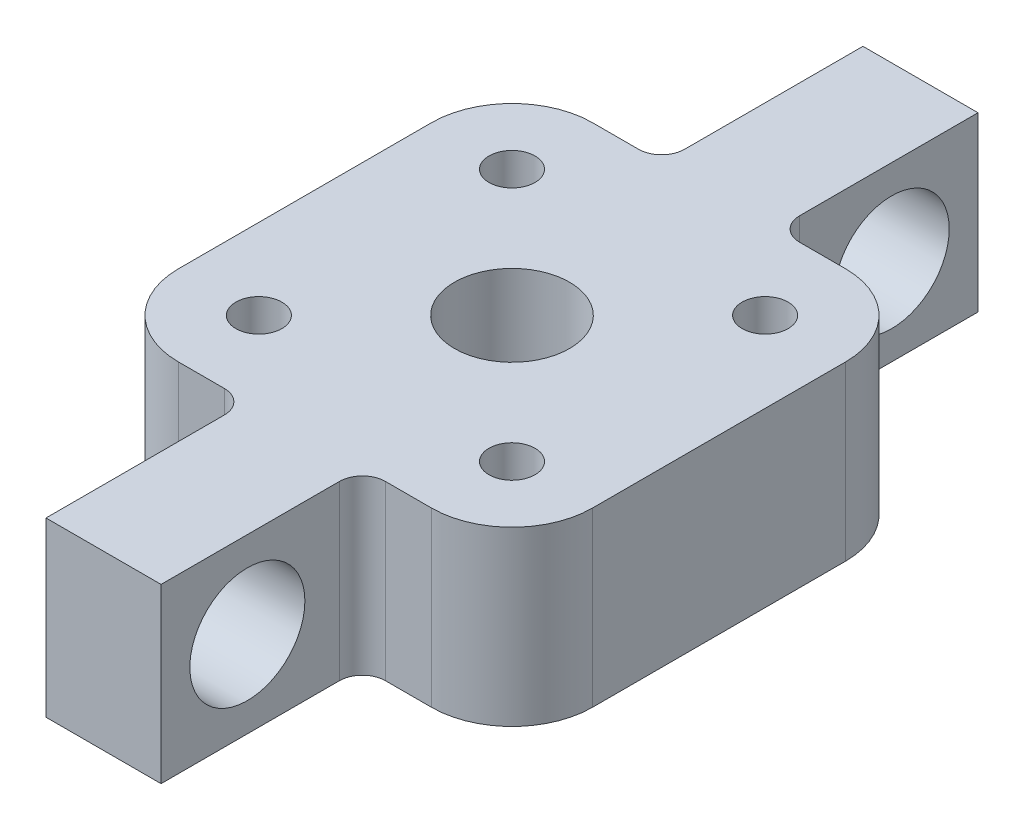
ISO-10303-21;
HEADER;
FILE_DESCRIPTION(('STEP AP214'),'2;1');
FILE_NAME('part.step','',(''),(''),'','','');
FILE_SCHEMA(('AUTOMOTIVE_DESIGN { 1 0 10303 214 1 1 1 1 }'));
ENDSEC;
DATA;
#1=APPLICATION_CONTEXT('core data for automotive mechanical design processes');
#2=APPLICATION_PROTOCOL_DEFINITION('international standard','automotive_design',2000,#1);
#3=PRODUCT_CONTEXT('',#1,'mechanical');
#4=PRODUCT('Part','Part','',(#3));
#5=PRODUCT_RELATED_PRODUCT_CATEGORY('part','',(#4));
#6=PRODUCT_DEFINITION_FORMATION('','',#4);
#7=PRODUCT_DEFINITION_CONTEXT('part definition',#1,'design');
#8=PRODUCT_DEFINITION('design','',#6,#7);
#9=PRODUCT_DEFINITION_SHAPE('','',#8);
#10=(LENGTH_UNIT() NAMED_UNIT(*) SI_UNIT(.MILLI.,.METRE.));
#11=(NAMED_UNIT(*) PLANE_ANGLE_UNIT() SI_UNIT($,.RADIAN.));
#12=(NAMED_UNIT(*) SI_UNIT($,.STERADIAN.) SOLID_ANGLE_UNIT());
#13=UNCERTAINTY_MEASURE_WITH_UNIT(LENGTH_MEASURE(1.E-05),#10,'distance_accuracy_value','');
#14=(GEOMETRIC_REPRESENTATION_CONTEXT(3) GLOBAL_UNCERTAINTY_ASSIGNED_CONTEXT((#13)) GLOBAL_UNIT_ASSIGNED_CONTEXT((#10,
#11,#12)) REPRESENTATION_CONTEXT('',''));
#15=CARTESIAN_POINT('',(0.,0.,0.));
#16=DIRECTION('',(0.,0.,1.));
#17=DIRECTION('',(1.,0.,0.));
#18=AXIS2_PLACEMENT_3D('',#15,#16,#17);
#19=CARTESIAN_POINT('',(0.,7.5,0.));
#20=DIRECTION('',(0.,1.,0.));
#21=DIRECTION('',(0.,0.,1.));
#22=AXIS2_PLACEMENT_3D('',#19,#20,#21);
#23=PLANE('',#22);
#24=CARTESIAN_POINT('',(11.,7.5,-11.));
#25=DIRECTION('',(0.,1.,0.));
#26=DIRECTION('',(0.,0.,1.));
#27=AXIS2_PLACEMENT_3D('',#24,#25,#26);
#28=CIRCLE('',#27,2.);
#29=CARTESIAN_POINT('',(11.,7.5,-9.));
#30=VERTEX_POINT('',#29);
#31=EDGE_CURVE('E476',#30,#30,#28,.T.);
#32=ORIENTED_EDGE('',*,*,#31,.F.);
#33=EDGE_LOOP('',(#32));
#34=FACE_BOUND('',#33,.T.);
#35=CARTESIAN_POINT('',(-11.,7.5,11.));
#36=DIRECTION('',(0.,1.,0.));
#37=DIRECTION('',(0.,0.,1.));
#38=AXIS2_PLACEMENT_3D('',#35,#36,#37);
#39=CIRCLE('',#38,2.);
#40=CARTESIAN_POINT('',(-11.,7.5,13.));
#41=VERTEX_POINT('',#40);
#42=EDGE_CURVE('E464',#41,#41,#39,.T.);
#43=ORIENTED_EDGE('',*,*,#42,.F.);
#44=EDGE_LOOP('',(#43));
#45=FACE_BOUND('',#44,.T.);
#46=DIRECTION('',(0.,0.,-1.));
#47=VECTOR('',#46,1.);
#48=CARTESIAN_POINT('',(5.,7.5,35.5));
#49=LINE('',#48,#47);
#50=CARTESIAN_POINT('',(5.,7.5,35.5));
#51=VERTEX_POINT('',#50);
#52=CARTESIAN_POINT('',(5.00000000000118,7.5,19.9999999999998));
#53=VERTEX_POINT('',#52);
#54=EDGE_CURVE('E206',#51,#53,#49,.T.);
#55=ORIENTED_EDGE('',*,*,#54,.T.);
#56=CARTESIAN_POINT('',(7.00000000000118,7.5,20.));
#57=DIRECTION('',(0.,1.,0.));
#58=DIRECTION('',(0.,0.,1.));
#59=AXIS2_PLACEMENT_3D('',#56,#57,#58);
#60=CIRCLE('',#59,2.);
#61=CARTESIAN_POINT('',(7.00000000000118,7.5,18.));
#62=VERTEX_POINT('',#61);
#63=EDGE_CURVE('E11',#53,#62,#60,.F.);
#64=ORIENTED_EDGE('',*,*,#63,.T.);
#65=DIRECTION('',(1.,0.,0.));
#66=VECTOR('',#65,1.);
#67=CARTESIAN_POINT('',(18.,7.5,18.));
#68=LINE('',#67,#66);
#69=CARTESIAN_POINT('',(11.,7.5,18.));
#70=VERTEX_POINT('',#69);
#71=EDGE_CURVE('E208',#62,#70,#68,.T.);
#72=ORIENTED_EDGE('',*,*,#71,.T.);
#73=CARTESIAN_POINT('',(11.,7.5,11.));
#74=DIRECTION('',(0.,1.,0.));
#75=DIRECTION('',(0.,0.,1.));
#76=AXIS2_PLACEMENT_3D('',#73,#74,#75);
#77=CIRCLE('',#76,7.);
#78=CARTESIAN_POINT('',(18.,7.5,11.));
#79=VERTEX_POINT('',#78);
#80=EDGE_CURVE('E290',#70,#79,#77,.T.);
#81=ORIENTED_EDGE('',*,*,#80,.T.);
#82=DIRECTION('',(0.,0.,-1.));
#83=VECTOR('',#82,1.);
#84=CARTESIAN_POINT('',(18.,7.5,-18.));
#85=LINE('',#84,#83);
#86=CARTESIAN_POINT('',(18.,7.5,-11.));
#87=VERTEX_POINT('',#86);
#88=EDGE_CURVE('E213',#79,#87,#85,.T.);
#89=ORIENTED_EDGE('',*,*,#88,.T.);
#90=CARTESIAN_POINT('',(11.,7.5,-11.));
#91=DIRECTION('',(0.,1.,0.));
#92=DIRECTION('',(0.,0.,1.));
#93=AXIS2_PLACEMENT_3D('',#90,#91,#92);
#94=CIRCLE('',#93,7.);
#95=CARTESIAN_POINT('',(11.,7.5,-18.));
#96=VERTEX_POINT('',#95);
#97=EDGE_CURVE('E288',#87,#96,#94,.T.);
#98=ORIENTED_EDGE('',*,*,#97,.T.);
#99=DIRECTION('',(-1.,0.,0.));
#100=VECTOR('',#99,1.);
#101=CARTESIAN_POINT('',(18.,7.5,-18.));
#102=LINE('',#101,#100);
#103=CARTESIAN_POINT('',(7.00000000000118,7.5,-18.));
#104=VERTEX_POINT('',#103);
#105=EDGE_CURVE('E216',#96,#104,#102,.T.);
#106=ORIENTED_EDGE('',*,*,#105,.T.);
#107=CARTESIAN_POINT('',(7.00000000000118,7.5,-20.));
#108=DIRECTION('',(0.,1.,0.));
#109=DIRECTION('',(0.,0.,1.));
#110=AXIS2_PLACEMENT_3D('',#107,#108,#109);
#111=CIRCLE('',#110,2.);
#112=CARTESIAN_POINT('',(5.00000000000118,7.5,-19.9999999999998));
#113=VERTEX_POINT('',#112);
#114=EDGE_CURVE('E333',#104,#113,#111,.F.);
#115=ORIENTED_EDGE('',*,*,#114,.T.);
#116=DIRECTION('',(0.,0.,-1.));
#117=VECTOR('',#116,1.);
#118=CARTESIAN_POINT('',(5.,7.5,-35.5));
#119=LINE('',#118,#117);
#120=CARTESIAN_POINT('',(5.,7.5,-35.5));
#121=VERTEX_POINT('',#120);
#122=EDGE_CURVE('E219',#113,#121,#119,.T.);
#123=ORIENTED_EDGE('',*,*,#122,.T.);
#124=DIRECTION('',(-1.,0.,0.));
#125=VECTOR('',#124,1.);
#126=CARTESIAN_POINT('',(-5.,7.5,-35.5));
#127=LINE('',#126,#125);
#128=CARTESIAN_POINT('',(-5.,7.5,-35.5));
#129=VERTEX_POINT('',#128);
#130=EDGE_CURVE('E221',#121,#129,#127,.T.);
#131=ORIENTED_EDGE('',*,*,#130,.T.);
#132=DIRECTION('',(0.,0.,1.));
#133=VECTOR('',#132,1.);
#134=CARTESIAN_POINT('',(-5.00000000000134,7.5,-18.));
#135=LINE('',#134,#133);
#136=CARTESIAN_POINT('',(-5.00000000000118,7.5,-19.9999999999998));
#137=VERTEX_POINT('',#136);
#138=EDGE_CURVE('E223',#129,#137,#135,.T.);
#139=ORIENTED_EDGE('',*,*,#138,.T.);
#140=CARTESIAN_POINT('',(-7.00000000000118,7.5,-20.));
#141=DIRECTION('',(0.,1.,0.));
#142=DIRECTION('',(0.,0.,1.));
#143=AXIS2_PLACEMENT_3D('',#140,#141,#142);
#144=CIRCLE('',#143,2.);
#145=CARTESIAN_POINT('',(-7.00000000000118,7.5,-18.));
#146=VERTEX_POINT('',#145);
#147=EDGE_CURVE('E329',#137,#146,#144,.F.);
#148=ORIENTED_EDGE('',*,*,#147,.T.);
#149=DIRECTION('',(-1.,0.,0.));
#150=VECTOR('',#149,1.);
#151=CARTESIAN_POINT('',(-5.00000000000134,7.5,-18.));
#152=LINE('',#151,#150);
#153=CARTESIAN_POINT('',(-11.,7.5,-18.));
#154=VERTEX_POINT('',#153);
#155=EDGE_CURVE('E226',#146,#154,#152,.T.);
#156=ORIENTED_EDGE('',*,*,#155,.T.);
#157=CARTESIAN_POINT('',(-11.,7.5,-11.));
#158=DIRECTION('',(0.,1.,0.));
#159=DIRECTION('',(0.,0.,1.));
#160=AXIS2_PLACEMENT_3D('',#157,#158,#159);
#161=CIRCLE('',#160,7.);
#162=CARTESIAN_POINT('',(-18.,7.5,-11.));
#163=VERTEX_POINT('',#162);
#164=EDGE_CURVE('E286',#154,#163,#161,.T.);
#165=ORIENTED_EDGE('',*,*,#164,.T.);
#166=DIRECTION('',(0.,0.,1.));
#167=VECTOR('',#166,1.);
#168=CARTESIAN_POINT('',(-18.,7.5,-18.));
#169=LINE('',#168,#167);
#170=CARTESIAN_POINT('',(-18.,7.5,11.));
#171=VERTEX_POINT('',#170);
#172=EDGE_CURVE('E228',#163,#171,#169,.T.);
#173=ORIENTED_EDGE('',*,*,#172,.T.);
#174=CARTESIAN_POINT('',(-11.,7.5,11.));
#175=DIRECTION('',(0.,1.,0.));
#176=DIRECTION('',(0.,0.,1.));
#177=AXIS2_PLACEMENT_3D('',#174,#175,#176);
#178=CIRCLE('',#177,7.);
#179=CARTESIAN_POINT('',(-11.,7.5,18.));
#180=VERTEX_POINT('',#179);
#181=EDGE_CURVE('E284',#171,#180,#178,.T.);
#182=ORIENTED_EDGE('',*,*,#181,.T.);
#183=DIRECTION('',(1.,0.,0.));
#184=VECTOR('',#183,1.);
#185=CARTESIAN_POINT('',(-5.00000000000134,7.5,18.));
#186=LINE('',#185,#184);
#187=CARTESIAN_POINT('',(-7.00000000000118,7.5,18.));
#188=VERTEX_POINT('',#187);
#189=EDGE_CURVE('E192',#180,#188,#186,.T.);
#190=ORIENTED_EDGE('',*,*,#189,.T.);
#191=CARTESIAN_POINT('',(-7.00000000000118,7.5,20.));
#192=DIRECTION('',(0.,1.,0.));
#193=DIRECTION('',(0.,0.,1.));
#194=AXIS2_PLACEMENT_3D('',#191,#192,#193);
#195=CIRCLE('',#194,2.);
#196=CARTESIAN_POINT('',(-5.00000000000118,7.5,19.9999999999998));
#197=VERTEX_POINT('',#196);
#198=EDGE_CURVE('E188',#188,#197,#195,.F.);
#199=ORIENTED_EDGE('',*,*,#198,.T.);
#200=DIRECTION('',(0.,0.,1.));
#201=VECTOR('',#200,1.);
#202=CARTESIAN_POINT('',(-5.00000000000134,7.5,18.));
#203=LINE('',#202,#201);
#204=CARTESIAN_POINT('',(-5.,7.5,35.5));
#205=VERTEX_POINT('',#204);
#206=EDGE_CURVE('E180',#197,#205,#203,.T.);
#207=ORIENTED_EDGE('',*,*,#206,.T.);
#208=DIRECTION('',(1.,0.,0.));
#209=VECTOR('',#208,1.);
#210=CARTESIAN_POINT('',(-5.,7.5,35.5));
#211=LINE('',#210,#209);
#212=EDGE_CURVE('E184',#205,#51,#211,.T.);
#213=ORIENTED_EDGE('',*,*,#212,.T.);
#214=EDGE_LOOP('',(#55,#64,#72,#81,#89,#98,#106,#115,#123,#131,#139,#148,#156,#165,#173,#182,
#190,#199,#207,#213));
#215=FACE_BOUND('',#214,.T.);
#216=CARTESIAN_POINT('',(0.,7.5,0.));
#217=DIRECTION('',(0.,1.,0.));
#218=DIRECTION('',(0.,0.,1.));
#219=AXIS2_PLACEMENT_3D('',#216,#217,#218);
#220=CIRCLE('',#219,5.);
#221=CARTESIAN_POINT('',(0.,7.5,5.));
#222=VERTEX_POINT('',#221);
#223=EDGE_CURVE('E235',#222,#222,#220,.T.);
#224=ORIENTED_EDGE('',*,*,#223,.F.);
#225=EDGE_LOOP('',(#224));
#226=FACE_BOUND('',#225,.T.);
#227=CARTESIAN_POINT('',(11.,7.5,11.));
#228=DIRECTION('',(0.,1.,0.));
#229=DIRECTION('',(0.,0.,1.));
#230=AXIS2_PLACEMENT_3D('',#227,#228,#229);
#231=CIRCLE('',#230,2.);
#232=CARTESIAN_POINT('',(11.,7.5,13.));
#233=VERTEX_POINT('',#232);
#234=EDGE_CURVE('E470',#233,#233,#231,.T.);
#235=ORIENTED_EDGE('',*,*,#234,.F.);
#236=EDGE_LOOP('',(#235));
#237=FACE_BOUND('',#236,.T.);
#238=CARTESIAN_POINT('',(-11.,7.5,-11.));
#239=DIRECTION('',(0.,1.,0.));
#240=DIRECTION('',(0.,0.,1.));
#241=AXIS2_PLACEMENT_3D('',#238,#239,#240);
#242=CIRCLE('',#241,2.);
#243=CARTESIAN_POINT('',(-11.,7.5,-9.));
#244=VERTEX_POINT('',#243);
#245=EDGE_CURVE('E482',#244,#244,#242,.T.);
#246=ORIENTED_EDGE('',*,*,#245,.F.);
#247=EDGE_LOOP('',(#246));
#248=FACE_BOUND('',#247,.T.);
#249=ADVANCED_FACE('F43',(#34,#45,#215,#226,#237,#248),#23,.T.);
#250=CARTESIAN_POINT('',(0.,-7.5,0.));
#251=DIRECTION('',(0.,1.,0.));
#252=DIRECTION('',(0.,0.,1.));
#253=AXIS2_PLACEMENT_3D('',#250,#251,#252);
#254=PLANE('',#253);
#255=DIRECTION('',(0.,0.,-1.));
#256=VECTOR('',#255,1.);
#257=CARTESIAN_POINT('',(18.,-7.5,-18.));
#258=LINE('',#257,#256);
#259=CARTESIAN_POINT('',(18.,-7.5,11.));
#260=VERTEX_POINT('',#259);
#261=CARTESIAN_POINT('',(18.,-7.5,-11.));
#262=VERTEX_POINT('',#261);
#263=EDGE_CURVE('E243',#260,#262,#258,.T.);
#264=ORIENTED_EDGE('',*,*,#263,.F.);
#265=CARTESIAN_POINT('',(11.,-7.5,11.));
#266=DIRECTION('',(0.,1.,0.));
#267=DIRECTION('',(0.,0.,1.));
#268=AXIS2_PLACEMENT_3D('',#265,#266,#267);
#269=CIRCLE('',#268,7.);
#270=CARTESIAN_POINT('',(11.,-7.5,18.));
#271=VERTEX_POINT('',#270);
#272=EDGE_CURVE('E278',#260,#271,#269,.F.);
#273=ORIENTED_EDGE('',*,*,#272,.T.);
#274=DIRECTION('',(1.,0.,0.));
#275=VECTOR('',#274,1.);
#276=CARTESIAN_POINT('',(18.,-7.5,18.));
#277=LINE('',#276,#275);
#278=CARTESIAN_POINT('',(7.00000000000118,-7.5,18.));
#279=VERTEX_POINT('',#278);
#280=EDGE_CURVE('E241',#279,#271,#277,.T.);
#281=ORIENTED_EDGE('',*,*,#280,.F.);
#282=CARTESIAN_POINT('',(7.00000000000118,-7.5,20.));
#283=DIRECTION('',(0.,1.,0.));
#284=DIRECTION('',(0.,0.,1.));
#285=AXIS2_PLACEMENT_3D('',#282,#283,#284);
#286=CIRCLE('',#285,2.);
#287=CARTESIAN_POINT('',(5.00000000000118,-7.5,19.9999999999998));
#288=VERTEX_POINT('',#287);
#289=EDGE_CURVE('E52',#279,#288,#286,.T.);
#290=ORIENTED_EDGE('',*,*,#289,.T.);
#291=DIRECTION('',(0.,0.,-1.));
#292=VECTOR('',#291,1.);
#293=CARTESIAN_POINT('',(5.,-7.5,35.5));
#294=LINE('',#293,#292);
#295=CARTESIAN_POINT('',(5.,-7.5,35.5));
#296=VERTEX_POINT('',#295);
#297=EDGE_CURVE('E239',#296,#288,#294,.T.);
#298=ORIENTED_EDGE('',*,*,#297,.F.);
#299=DIRECTION('',(1.,0.,0.));
#300=VECTOR('',#299,1.);
#301=CARTESIAN_POINT('',(-5.,-7.5,35.5));
#302=LINE('',#301,#300);
#303=CARTESIAN_POINT('',(-5.,-7.5,35.5));
#304=VERTEX_POINT('',#303);
#305=EDGE_CURVE('E237',#304,#296,#302,.T.);
#306=ORIENTED_EDGE('',*,*,#305,.F.);
#307=DIRECTION('',(0.,0.,1.));
#308=VECTOR('',#307,1.);
#309=CARTESIAN_POINT('',(-5.00000000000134,-7.5,18.));
#310=LINE('',#309,#308);
#311=CARTESIAN_POINT('',(-5.00000000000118,-7.5,19.9999999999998));
#312=VERTEX_POINT('',#311);
#313=EDGE_CURVE('E198',#312,#304,#310,.T.);
#314=ORIENTED_EDGE('',*,*,#313,.F.);
#315=CARTESIAN_POINT('',(-7.00000000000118,-7.5,20.));
#316=DIRECTION('',(0.,1.,0.));
#317=DIRECTION('',(0.,0.,1.));
#318=AXIS2_PLACEMENT_3D('',#315,#316,#317);
#319=CIRCLE('',#318,2.);
#320=CARTESIAN_POINT('',(-7.00000000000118,-7.5,18.));
#321=VERTEX_POINT('',#320);
#322=EDGE_CURVE('E324',#312,#321,#319,.T.);
#323=ORIENTED_EDGE('',*,*,#322,.T.);
#324=DIRECTION('',(1.,0.,0.));
#325=VECTOR('',#324,1.);
#326=CARTESIAN_POINT('',(-5.00000000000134,-7.5,18.));
#327=LINE('',#326,#325);
#328=CARTESIAN_POINT('',(-11.,-7.5,18.));
#329=VERTEX_POINT('',#328);
#330=EDGE_CURVE('E232',#329,#321,#327,.T.);
#331=ORIENTED_EDGE('',*,*,#330,.F.);
#332=CARTESIAN_POINT('',(-11.,-7.5,11.));
#333=DIRECTION('',(0.,1.,0.));
#334=DIRECTION('',(0.,0.,1.));
#335=AXIS2_PLACEMENT_3D('',#332,#333,#334);
#336=CIRCLE('',#335,7.);
#337=CARTESIAN_POINT('',(-18.,-7.5,11.));
#338=VERTEX_POINT('',#337);
#339=EDGE_CURVE('E271',#329,#338,#336,.F.);
#340=ORIENTED_EDGE('',*,*,#339,.T.);
#341=DIRECTION('',(0.,0.,1.));
#342=VECTOR('',#341,1.);
#343=CARTESIAN_POINT('',(-18.,-7.5,-18.));
#344=LINE('',#343,#342);
#345=CARTESIAN_POINT('',(-18.,-7.5,-11.));
#346=VERTEX_POINT('',#345);
#347=EDGE_CURVE('E258',#346,#338,#344,.T.);
#348=ORIENTED_EDGE('',*,*,#347,.F.);
#349=CARTESIAN_POINT('',(-11.,-7.5,-11.));
#350=DIRECTION('',(0.,1.,0.));
#351=DIRECTION('',(0.,0.,1.));
#352=AXIS2_PLACEMENT_3D('',#349,#350,#351);
#353=CIRCLE('',#352,7.);
#354=CARTESIAN_POINT('',(-11.,-7.5,-18.));
#355=VERTEX_POINT('',#354);
#356=EDGE_CURVE('E273',#346,#355,#353,.F.);
#357=ORIENTED_EDGE('',*,*,#356,.T.);
#358=DIRECTION('',(-1.,0.,0.));
#359=VECTOR('',#358,1.);
#360=CARTESIAN_POINT('',(-5.00000000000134,-7.5,-18.));
#361=LINE('',#360,#359);
#362=CARTESIAN_POINT('',(-7.00000000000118,-7.5,-18.));
#363=VERTEX_POINT('',#362);
#364=EDGE_CURVE('E256',#363,#355,#361,.T.);
#365=ORIENTED_EDGE('',*,*,#364,.F.);
#366=CARTESIAN_POINT('',(-7.00000000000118,-7.5,-20.));
#367=DIRECTION('',(0.,1.,0.));
#368=DIRECTION('',(0.,0.,1.));
#369=AXIS2_PLACEMENT_3D('',#366,#367,#368);
#370=CIRCLE('',#369,2.);
#371=CARTESIAN_POINT('',(-5.00000000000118,-7.5,-19.9999999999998));
#372=VERTEX_POINT('',#371);
#373=EDGE_CURVE('E327',#363,#372,#370,.T.);
#374=ORIENTED_EDGE('',*,*,#373,.T.);
#375=DIRECTION('',(0.,0.,1.));
#376=VECTOR('',#375,1.);
#377=CARTESIAN_POINT('',(-5.00000000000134,-7.5,-18.));
#378=LINE('',#377,#376);
#379=CARTESIAN_POINT('',(-5.,-7.5,-35.5));
#380=VERTEX_POINT('',#379);
#381=EDGE_CURVE('E253',#380,#372,#378,.T.);
#382=ORIENTED_EDGE('',*,*,#381,.F.);
#383=DIRECTION('',(-1.,0.,0.));
#384=VECTOR('',#383,1.);
#385=CARTESIAN_POINT('',(-5.,-7.5,-35.5));
#386=LINE('',#385,#384);
#387=CARTESIAN_POINT('',(5.,-7.5,-35.5));
#388=VERTEX_POINT('',#387);
#389=EDGE_CURVE('E251',#388,#380,#386,.T.);
#390=ORIENTED_EDGE('',*,*,#389,.F.);
#391=DIRECTION('',(0.,0.,-1.));
#392=VECTOR('',#391,1.);
#393=CARTESIAN_POINT('',(5.,-7.5,-35.5));
#394=LINE('',#393,#392);
#395=CARTESIAN_POINT('',(5.00000000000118,-7.5,-19.9999999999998));
#396=VERTEX_POINT('',#395);
#397=EDGE_CURVE('E249',#396,#388,#394,.T.);
#398=ORIENTED_EDGE('',*,*,#397,.F.);
#399=CARTESIAN_POINT('',(7.00000000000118,-7.5,-20.));
#400=DIRECTION('',(0.,1.,0.));
#401=DIRECTION('',(0.,0.,1.));
#402=AXIS2_PLACEMENT_3D('',#399,#400,#401);
#403=CIRCLE('',#402,2.);
#404=CARTESIAN_POINT('',(7.00000000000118,-7.5,-18.));
#405=VERTEX_POINT('',#404);
#406=EDGE_CURVE('E331',#396,#405,#403,.T.);
#407=ORIENTED_EDGE('',*,*,#406,.T.);
#408=DIRECTION('',(-1.,0.,0.));
#409=VECTOR('',#408,1.);
#410=CARTESIAN_POINT('',(18.,-7.5,-18.));
#411=LINE('',#410,#409);
#412=CARTESIAN_POINT('',(11.,-7.5,-18.));
#413=VERTEX_POINT('',#412);
#414=EDGE_CURVE('E246',#413,#405,#411,.T.);
#415=ORIENTED_EDGE('',*,*,#414,.F.);
#416=CARTESIAN_POINT('',(11.,-7.5,-11.));
#417=DIRECTION('',(0.,1.,0.));
#418=DIRECTION('',(0.,0.,1.));
#419=AXIS2_PLACEMENT_3D('',#416,#417,#418);
#420=CIRCLE('',#419,7.);
#421=EDGE_CURVE('E276',#413,#262,#420,.F.);
#422=ORIENTED_EDGE('',*,*,#421,.T.);
#423=EDGE_LOOP('',(#264,#273,#281,#290,#298,#306,#314,#323,#331,#340,#348,#357,#365,#374,#382,
#390,#398,#407,#415,#422));
#424=FACE_BOUND('',#423,.T.);
#425=CARTESIAN_POINT('',(0.,-7.5,0.));
#426=DIRECTION('',(0.,1.,0.));
#427=DIRECTION('',(0.,0.,1.));
#428=AXIS2_PLACEMENT_3D('',#425,#426,#427);
#429=CIRCLE('',#428,5.);
#430=CARTESIAN_POINT('',(0.,-7.5,5.));
#431=VERTEX_POINT('',#430);
#432=EDGE_CURVE('E461',#431,#431,#429,.T.);
#433=ORIENTED_EDGE('',*,*,#432,.T.);
#434=EDGE_LOOP('',(#433));
#435=FACE_BOUND('',#434,.T.);
#436=CARTESIAN_POINT('',(-11.,-7.5,11.));
#437=DIRECTION('',(0.,1.,0.));
#438=DIRECTION('',(0.,0.,1.));
#439=AXIS2_PLACEMENT_3D('',#436,#437,#438);
#440=CIRCLE('',#439,2.);
#441=CARTESIAN_POINT('',(-11.,-7.5,13.));
#442=VERTEX_POINT('',#441);
#443=EDGE_CURVE('E467',#442,#442,#440,.T.);
#444=ORIENTED_EDGE('',*,*,#443,.T.);
#445=EDGE_LOOP('',(#444));
#446=FACE_BOUND('',#445,.T.);
#447=CARTESIAN_POINT('',(11.,-7.5,11.));
#448=DIRECTION('',(0.,1.,0.));
#449=DIRECTION('',(0.,0.,1.));
#450=AXIS2_PLACEMENT_3D('',#447,#448,#449);
#451=CIRCLE('',#450,2.);
#452=CARTESIAN_POINT('',(11.,-7.5,13.));
#453=VERTEX_POINT('',#452);
#454=EDGE_CURVE('E473',#453,#453,#451,.T.);
#455=ORIENTED_EDGE('',*,*,#454,.T.);
#456=EDGE_LOOP('',(#455));
#457=FACE_BOUND('',#456,.T.);
#458=CARTESIAN_POINT('',(11.,-7.5,-11.));
#459=DIRECTION('',(0.,1.,0.));
#460=DIRECTION('',(0.,0.,1.));
#461=AXIS2_PLACEMENT_3D('',#458,#459,#460);
#462=CIRCLE('',#461,2.);
#463=CARTESIAN_POINT('',(11.,-7.5,-9.));
#464=VERTEX_POINT('',#463);
#465=EDGE_CURVE('E479',#464,#464,#462,.T.);
#466=ORIENTED_EDGE('',*,*,#465,.T.);
#467=EDGE_LOOP('',(#466));
#468=FACE_BOUND('',#467,.T.);
#469=CARTESIAN_POINT('',(-11.,-7.5,-11.));
#470=DIRECTION('',(0.,1.,0.));
#471=DIRECTION('',(0.,0.,1.));
#472=AXIS2_PLACEMENT_3D('',#469,#470,#471);
#473=CIRCLE('',#472,2.);
#474=CARTESIAN_POINT('',(-11.,-7.5,-9.));
#475=VERTEX_POINT('',#474);
#476=EDGE_CURVE('E485',#475,#475,#473,.T.);
#477=ORIENTED_EDGE('',*,*,#476,.T.);
#478=EDGE_LOOP('',(#477));
#479=FACE_BOUND('',#478,.T.);
#480=ADVANCED_FACE('F349',(#424,#435,#446,#457,#468,#479),#254,.F.);
#481=CARTESIAN_POINT('',(-5.00000000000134,7.5,18.));
#482=DIRECTION('',(0.,0.,-1.));
#483=DIRECTION('',(-1.,0.,0.));
#484=AXIS2_PLACEMENT_3D('',#481,#482,#483);
#485=PLANE('',#484);
#486=ORIENTED_EDGE('',*,*,#330,.T.);
#487=DIRECTION('',(0.,-1.,0.));
#488=VECTOR('',#487,1.);
#489=CARTESIAN_POINT('',(-7.00000000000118,7.5,18.));
#490=LINE('',#489,#488);
#491=EDGE_CURVE('E308',#321,#188,#490,.F.);
#492=ORIENTED_EDGE('',*,*,#491,.T.);
#493=ORIENTED_EDGE('',*,*,#189,.F.);
#494=DIRECTION('',(0.,-1.,0.));
#495=VECTOR('',#494,1.);
#496=CARTESIAN_POINT('',(-11.,7.5,18.));
#497=LINE('',#496,#495);
#498=EDGE_CURVE('E303',#180,#329,#497,.T.);
#499=ORIENTED_EDGE('',*,*,#498,.T.);
#500=EDGE_LOOP('',(#486,#492,#493,#499));
#501=FACE_BOUND('',#500,.T.);
#502=ADVANCED_FACE('F378',(#501),#485,.F.);
#503=CARTESIAN_POINT('',(-5.00000000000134,7.5,18.));
#504=DIRECTION('',(1.,0.,0.));
#505=DIRECTION('',(0.,0.,-1.));
#506=AXIS2_PLACEMENT_3D('',#503,#504,#505);
#507=PLANE('',#506);
#508=CARTESIAN_POINT('',(-5.00000000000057,0.,28.0000000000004));
#509=DIRECTION('',(1.,0.,0.));
#510=DIRECTION('',(0.,0.,-1.));
#511=AXIS2_PLACEMENT_3D('',#508,#509,#510);
#512=CIRCLE('',#511,5.);
#513=CARTESIAN_POINT('',(-5.00000000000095,0.,23.0000000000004));
#514=VERTEX_POINT('',#513);
#515=EDGE_CURVE('E488',#514,#514,#512,.T.);
#516=ORIENTED_EDGE('',*,*,#515,.T.);
#517=EDGE_LOOP('',(#516));
#518=FACE_BOUND('',#517,.T.);
#519=ORIENTED_EDGE('',*,*,#206,.F.);
#520=DIRECTION('',(0.,-1.,0.));
#521=VECTOR('',#520,1.);
#522=CARTESIAN_POINT('',(-5.00000000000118,-7.5,19.9999999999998));
#523=LINE('',#522,#521);
#524=EDGE_CURVE('E306',#197,#312,#523,.T.);
#525=ORIENTED_EDGE('',*,*,#524,.T.);
#526=ORIENTED_EDGE('',*,*,#313,.T.);
#527=DIRECTION('',(0.,-1.,0.));
#528=VECTOR('',#527,1.);
#529=CARTESIAN_POINT('',(-5.,7.5,35.5));
#530=LINE('',#529,#528);
#531=EDGE_CURVE('E195',#205,#304,#530,.T.);
#532=ORIENTED_EDGE('',*,*,#531,.F.);
#533=EDGE_LOOP('',(#519,#525,#526,#532));
#534=FACE_BOUND('',#533,.T.);
#535=ADVANCED_FACE('F196',(#518,#534),#507,.F.);
#536=CARTESIAN_POINT('',(-5.,7.5,35.5));
#537=DIRECTION('',(0.,0.,-1.));
#538=DIRECTION('',(-1.,0.,0.));
#539=AXIS2_PLACEMENT_3D('',#536,#537,#538);
#540=PLANE('',#539);
#541=ORIENTED_EDGE('',*,*,#305,.T.);
#542=DIRECTION('',(0.,-1.,0.));
#543=VECTOR('',#542,1.);
#544=CARTESIAN_POINT('',(5.,7.5,35.5));
#545=LINE('',#544,#543);
#546=EDGE_CURVE('E202',#51,#296,#545,.T.);
#547=ORIENTED_EDGE('',*,*,#546,.F.);
#548=ORIENTED_EDGE('',*,*,#212,.F.);
#549=ORIENTED_EDGE('',*,*,#531,.T.);
#550=EDGE_LOOP('',(#541,#547,#548,#549));
#551=FACE_BOUND('',#550,.T.);
#552=ADVANCED_FACE('F204',(#551),#540,.F.);
#553=CARTESIAN_POINT('',(5.,7.5,35.5));
#554=DIRECTION('',(-1.,0.,0.));
#555=DIRECTION('',(0.,0.,1.));
#556=AXIS2_PLACEMENT_3D('',#553,#554,#555);
#557=PLANE('',#556);
#558=CARTESIAN_POINT('',(5.00000000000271,0.,28.0000000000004));
#559=DIRECTION('',(1.,0.,0.));
#560=DIRECTION('',(0.,0.,-1.));
#561=AXIS2_PLACEMENT_3D('',#558,#559,#560);
#562=CIRCLE('',#561,5.);
#563=CARTESIAN_POINT('',(5.00000000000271,0.,23.0000000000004));
#564=VERTEX_POINT('',#563);
#565=EDGE_CURVE('E493',#564,#564,#562,.T.);
#566=ORIENTED_EDGE('',*,*,#565,.F.);
#567=EDGE_LOOP('',(#566));
#568=FACE_BOUND('',#567,.T.);
#569=ORIENTED_EDGE('',*,*,#297,.T.);
#570=DIRECTION('',(0.,-1.,0.));
#571=VECTOR('',#570,1.);
#572=CARTESIAN_POINT('',(5.00000000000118,7.5,19.9999999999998));
#573=LINE('',#572,#571);
#574=EDGE_CURVE('E59',#288,#53,#573,.F.);
#575=ORIENTED_EDGE('',*,*,#574,.T.);
#576=ORIENTED_EDGE('',*,*,#54,.F.);
#577=ORIENTED_EDGE('',*,*,#546,.T.);
#578=EDGE_LOOP('',(#569,#575,#576,#577));
#579=FACE_BOUND('',#578,.T.);
#580=ADVANCED_FACE('F373',(#568,#579),#557,.F.);
#581=CARTESIAN_POINT('',(18.,7.5,18.));
#582=DIRECTION('',(0.,0.,-1.));
#583=DIRECTION('',(-1.,0.,0.));
#584=AXIS2_PLACEMENT_3D('',#581,#582,#583);
#585=PLANE('',#584);
#586=ORIENTED_EDGE('',*,*,#71,.F.);
#587=DIRECTION('',(0.,-1.,0.));
#588=VECTOR('',#587,1.);
#589=CARTESIAN_POINT('',(7.00000000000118,-7.5,18.));
#590=LINE('',#589,#588);
#591=EDGE_CURVE('E320',#62,#279,#590,.T.);
#592=ORIENTED_EDGE('',*,*,#591,.T.);
#593=ORIENTED_EDGE('',*,*,#280,.T.);
#594=DIRECTION('',(0.,-1.,0.));
#595=VECTOR('',#594,1.);
#596=CARTESIAN_POINT('',(11.,7.5,18.));
#597=LINE('',#596,#595);
#598=EDGE_CURVE('E281',#271,#70,#597,.F.);
#599=ORIENTED_EDGE('',*,*,#598,.T.);
#600=EDGE_LOOP('',(#586,#592,#593,#599));
#601=FACE_BOUND('',#600,.T.);
#602=ADVANCED_FACE('F369',(#601),#585,.F.);
#603=CARTESIAN_POINT('',(18.,7.5,-18.));
#604=DIRECTION('',(-1.,0.,0.));
#605=DIRECTION('',(0.,0.,1.));
#606=AXIS2_PLACEMENT_3D('',#603,#604,#605);
#607=PLANE('',#606);
#608=ORIENTED_EDGE('',*,*,#88,.F.);
#609=DIRECTION('',(0.,-1.,0.));
#610=VECTOR('',#609,1.);
#611=CARTESIAN_POINT('',(18.,7.5,11.));
#612=LINE('',#611,#610);
#613=EDGE_CURVE('E268',#79,#260,#612,.T.);
#614=ORIENTED_EDGE('',*,*,#613,.T.);
#615=ORIENTED_EDGE('',*,*,#263,.T.);
#616=DIRECTION('',(0.,-1.,0.));
#617=VECTOR('',#616,1.);
#618=CARTESIAN_POINT('',(18.,7.5,-11.));
#619=LINE('',#618,#617);
#620=EDGE_CURVE('E201',#262,#87,#619,.F.);
#621=ORIENTED_EDGE('',*,*,#620,.T.);
#622=EDGE_LOOP('',(#608,#614,#615,#621));
#623=FACE_BOUND('',#622,.T.);
#624=ADVANCED_FACE('F361',(#623),#607,.F.);
#625=CARTESIAN_POINT('',(18.,7.5,-18.));
#626=DIRECTION('',(0.,0.,1.));
#627=DIRECTION('',(1.,0.,0.));
#628=AXIS2_PLACEMENT_3D('',#625,#626,#627);
#629=PLANE('',#628);
#630=ORIENTED_EDGE('',*,*,#414,.T.);
#631=DIRECTION('',(0.,-1.,0.));
#632=VECTOR('',#631,1.);
#633=CARTESIAN_POINT('',(7.00000000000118,7.5,-18.));
#634=LINE('',#633,#632);
#635=EDGE_CURVE('E318',#405,#104,#634,.F.);
#636=ORIENTED_EDGE('',*,*,#635,.T.);
#637=ORIENTED_EDGE('',*,*,#105,.F.);
#638=DIRECTION('',(0.,-1.,0.));
#639=VECTOR('',#638,1.);
#640=CARTESIAN_POINT('',(11.,7.5,-18.));
#641=LINE('',#640,#639);
#642=EDGE_CURVE('E292',#96,#413,#641,.T.);
#643=ORIENTED_EDGE('',*,*,#642,.T.);
#644=EDGE_LOOP('',(#630,#636,#637,#643));
#645=FACE_BOUND('',#644,.T.);
#646=ADVANCED_FACE('F353',(#645),#629,.F.);
#647=CARTESIAN_POINT('',(5.,7.5,-35.5));
#648=DIRECTION('',(-1.,0.,0.));
#649=DIRECTION('',(0.,0.,1.));
#650=AXIS2_PLACEMENT_3D('',#647,#648,#649);
#651=PLANE('',#650);
#652=CARTESIAN_POINT('',(5.00000000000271,0.,-27.9999999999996));
#653=DIRECTION('',(1.,0.,0.));
#654=DIRECTION('',(0.,0.,-1.));
#655=AXIS2_PLACEMENT_3D('',#652,#653,#654);
#656=CIRCLE('',#655,5.);
#657=CARTESIAN_POINT('',(5.00000000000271,0.,-32.9999999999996));
#658=VERTEX_POINT('',#657);
#659=EDGE_CURVE('E496',#658,#658,#656,.T.);
#660=ORIENTED_EDGE('',*,*,#659,.F.);
#661=EDGE_LOOP('',(#660));
#662=FACE_BOUND('',#661,.T.);
#663=ORIENTED_EDGE('',*,*,#122,.F.);
#664=DIRECTION('',(0.,-1.,0.));
#665=VECTOR('',#664,1.);
#666=CARTESIAN_POINT('',(5.00000000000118,-7.5,-19.9999999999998));
#667=LINE('',#666,#665);
#668=EDGE_CURVE('E315',#113,#396,#667,.T.);
#669=ORIENTED_EDGE('',*,*,#668,.T.);
#670=ORIENTED_EDGE('',*,*,#397,.T.);
#671=DIRECTION('',(0.,-1.,0.));
#672=VECTOR('',#671,1.);
#673=CARTESIAN_POINT('',(5.,7.5,-35.5));
#674=LINE('',#673,#672);
#675=EDGE_CURVE('E263',#121,#388,#674,.T.);
#676=ORIENTED_EDGE('',*,*,#675,.F.);
#677=EDGE_LOOP('',(#663,#669,#670,#676));
#678=FACE_BOUND('',#677,.T.);
#679=ADVANCED_FACE('F343',(#662,#678),#651,.F.);
#680=CARTESIAN_POINT('',(-5.,7.5,-35.5));
#681=DIRECTION('',(0.,0.,1.));
#682=DIRECTION('',(1.,0.,0.));
#683=AXIS2_PLACEMENT_3D('',#680,#681,#682);
#684=PLANE('',#683);
#685=ORIENTED_EDGE('',*,*,#389,.T.);
#686=DIRECTION('',(0.,-1.,0.));
#687=VECTOR('',#686,1.);
#688=CARTESIAN_POINT('',(-5.,7.5,-35.5));
#689=LINE('',#688,#687);
#690=EDGE_CURVE('E231',#129,#380,#689,.T.);
#691=ORIENTED_EDGE('',*,*,#690,.F.);
#692=ORIENTED_EDGE('',*,*,#130,.F.);
#693=ORIENTED_EDGE('',*,*,#675,.T.);
#694=EDGE_LOOP('',(#685,#691,#692,#693));
#695=FACE_BOUND('',#694,.T.);
#696=ADVANCED_FACE('F419',(#695),#684,.F.);
#697=CARTESIAN_POINT('',(-5.00000000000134,7.5,-18.));
#698=DIRECTION('',(1.,0.,0.));
#699=DIRECTION('',(0.,0.,-1.));
#700=AXIS2_PLACEMENT_3D('',#697,#698,#699);
#701=PLANE('',#700);
#702=CARTESIAN_POINT('',(-5.00000000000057,0.,-27.9999999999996));
#703=DIRECTION('',(1.,0.,0.));
#704=DIRECTION('',(0.,0.,-1.));
#705=AXIS2_PLACEMENT_3D('',#702,#703,#704);
#706=CIRCLE('',#705,5.);
#707=CARTESIAN_POINT('',(-5.00000000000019,0.,-32.9999999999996));
#708=VERTEX_POINT('',#707);
#709=EDGE_CURVE('E47',#708,#708,#706,.T.);
#710=ORIENTED_EDGE('',*,*,#709,.T.);
#711=EDGE_LOOP('',(#710));
#712=FACE_BOUND('',#711,.T.);
#713=ORIENTED_EDGE('',*,*,#381,.T.);
#714=DIRECTION('',(0.,-1.,0.));
#715=VECTOR('',#714,1.);
#716=CARTESIAN_POINT('',(-5.00000000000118,7.5,-19.9999999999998));
#717=LINE('',#716,#715);
#718=EDGE_CURVE('E313',#372,#137,#717,.F.);
#719=ORIENTED_EDGE('',*,*,#718,.T.);
#720=ORIENTED_EDGE('',*,*,#138,.F.);
#721=ORIENTED_EDGE('',*,*,#690,.T.);
#722=EDGE_LOOP('',(#713,#719,#720,#721));
#723=FACE_BOUND('',#722,.T.);
#724=ADVANCED_FACE('F415',(#712,#723),#701,.F.);
#725=CARTESIAN_POINT('',(-5.00000000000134,7.5,-18.));
#726=DIRECTION('',(0.,0.,1.));
#727=DIRECTION('',(1.,0.,0.));
#728=AXIS2_PLACEMENT_3D('',#725,#726,#727);
#729=PLANE('',#728);
#730=ORIENTED_EDGE('',*,*,#155,.F.);
#731=DIRECTION('',(0.,-1.,0.));
#732=VECTOR('',#731,1.);
#733=CARTESIAN_POINT('',(-7.00000000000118,-7.5,-18.));
#734=LINE('',#733,#732);
#735=EDGE_CURVE('E310',#146,#363,#734,.T.);
#736=ORIENTED_EDGE('',*,*,#735,.T.);
#737=ORIENTED_EDGE('',*,*,#364,.T.);
#738=DIRECTION('',(0.,-1.,0.));
#739=VECTOR('',#738,1.);
#740=CARTESIAN_POINT('',(-11.,7.5,-18.));
#741=LINE('',#740,#739);
#742=EDGE_CURVE('E300',#355,#154,#741,.F.);
#743=ORIENTED_EDGE('',*,*,#742,.T.);
#744=EDGE_LOOP('',(#730,#736,#737,#743));
#745=FACE_BOUND('',#744,.T.);
#746=ADVANCED_FACE('F412',(#745),#729,.F.);
#747=CARTESIAN_POINT('',(-18.,7.5,-18.));
#748=DIRECTION('',(1.,0.,0.));
#749=DIRECTION('',(0.,0.,-1.));
#750=AXIS2_PLACEMENT_3D('',#747,#748,#749);
#751=PLANE('',#750);
#752=ORIENTED_EDGE('',*,*,#172,.F.);
#753=DIRECTION('',(0.,-1.,0.));
#754=VECTOR('',#753,1.);
#755=CARTESIAN_POINT('',(-18.,7.5,-11.));
#756=LINE('',#755,#754);
#757=EDGE_CURVE('E297',#163,#346,#756,.T.);
#758=ORIENTED_EDGE('',*,*,#757,.T.);
#759=ORIENTED_EDGE('',*,*,#347,.T.);
#760=DIRECTION('',(0.,-1.,0.));
#761=VECTOR('',#760,1.);
#762=CARTESIAN_POINT('',(-18.,7.5,11.));
#763=LINE('',#762,#761);
#764=EDGE_CURVE('E295',#338,#171,#763,.F.);
#765=ORIENTED_EDGE('',*,*,#764,.T.);
#766=EDGE_LOOP('',(#752,#758,#759,#765));
#767=FACE_BOUND('',#766,.T.);
#768=ADVANCED_FACE('F409',(#767),#751,.F.);
#769=CARTESIAN_POINT('',(0.,7.5,0.));
#770=DIRECTION('',(0.,-1.,0.));
#771=DIRECTION('',(0.,0.,-1.));
#772=AXIS2_PLACEMENT_3D('',#769,#770,#771);
#773=CYLINDRICAL_SURFACE('',#772,5.);
#774=ORIENTED_EDGE('',*,*,#223,.T.);
#775=EDGE_LOOP('',(#774));
#776=FACE_BOUND('',#775,.T.);
#777=ORIENTED_EDGE('',*,*,#432,.F.);
#778=EDGE_LOOP('',(#777));
#779=FACE_BOUND('',#778,.T.);
#780=ADVANCED_FACE('F406',(#776,#779),#773,.F.);
#781=CARTESIAN_POINT('',(-11.,7.5,11.));
#782=DIRECTION('',(0.,-1.,0.));
#783=DIRECTION('',(0.,0.,-1.));
#784=AXIS2_PLACEMENT_3D('',#781,#782,#783);
#785=CYLINDRICAL_SURFACE('',#784,2.);
#786=ORIENTED_EDGE('',*,*,#42,.T.);
#787=EDGE_LOOP('',(#786));
#788=FACE_BOUND('',#787,.T.);
#789=ORIENTED_EDGE('',*,*,#443,.F.);
#790=EDGE_LOOP('',(#789));
#791=FACE_BOUND('',#790,.T.);
#792=ADVANCED_FACE('F523',(#788,#791),#785,.F.);
#793=CARTESIAN_POINT('',(11.,7.5,11.));
#794=DIRECTION('',(0.,-1.,0.));
#795=DIRECTION('',(0.,0.,-1.));
#796=AXIS2_PLACEMENT_3D('',#793,#794,#795);
#797=CYLINDRICAL_SURFACE('',#796,2.);
#798=ORIENTED_EDGE('',*,*,#234,.T.);
#799=EDGE_LOOP('',(#798));
#800=FACE_BOUND('',#799,.T.);
#801=ORIENTED_EDGE('',*,*,#454,.F.);
#802=EDGE_LOOP('',(#801));
#803=FACE_BOUND('',#802,.T.);
#804=ADVANCED_FACE('F520',(#800,#803),#797,.F.);
#805=CARTESIAN_POINT('',(11.,7.5,-11.));
#806=DIRECTION('',(0.,-1.,0.));
#807=DIRECTION('',(0.,0.,-1.));
#808=AXIS2_PLACEMENT_3D('',#805,#806,#807);
#809=CYLINDRICAL_SURFACE('',#808,2.);
#810=ORIENTED_EDGE('',*,*,#31,.T.);
#811=EDGE_LOOP('',(#810));
#812=FACE_BOUND('',#811,.T.);
#813=ORIENTED_EDGE('',*,*,#465,.F.);
#814=EDGE_LOOP('',(#813));
#815=FACE_BOUND('',#814,.T.);
#816=ADVANCED_FACE('F516',(#812,#815),#809,.F.);
#817=CARTESIAN_POINT('',(-11.,7.5,-11.));
#818=DIRECTION('',(0.,-1.,0.));
#819=DIRECTION('',(0.,0.,-1.));
#820=AXIS2_PLACEMENT_3D('',#817,#818,#819);
#821=CYLINDRICAL_SURFACE('',#820,2.);
#822=ORIENTED_EDGE('',*,*,#245,.T.);
#823=EDGE_LOOP('',(#822));
#824=FACE_BOUND('',#823,.T.);
#825=ORIENTED_EDGE('',*,*,#476,.F.);
#826=EDGE_LOOP('',(#825));
#827=FACE_BOUND('',#826,.T.);
#828=ADVANCED_FACE('F445',(#824,#827),#821,.F.);
#829=CARTESIAN_POINT('',(11.,7.5,11.));
#830=DIRECTION('',(0.,-1.,0.));
#831=DIRECTION('',(0.,0.,-1.));
#832=AXIS2_PLACEMENT_3D('',#829,#830,#831);
#833=CYLINDRICAL_SURFACE('',#832,7.);
#834=ORIENTED_EDGE('',*,*,#80,.F.);
#835=ORIENTED_EDGE('',*,*,#598,.F.);
#836=ORIENTED_EDGE('',*,*,#272,.F.);
#837=ORIENTED_EDGE('',*,*,#613,.F.);
#838=EDGE_LOOP('',(#834,#835,#836,#837));
#839=FACE_BOUND('',#838,.T.);
#840=ADVANCED_FACE('F365',(#839),#833,.T.);
#841=CARTESIAN_POINT('',(11.,7.5,-11.));
#842=DIRECTION('',(0.,-1.,0.));
#843=DIRECTION('',(0.,0.,-1.));
#844=AXIS2_PLACEMENT_3D('',#841,#842,#843);
#845=CYLINDRICAL_SURFACE('',#844,7.);
#846=ORIENTED_EDGE('',*,*,#97,.F.);
#847=ORIENTED_EDGE('',*,*,#620,.F.);
#848=ORIENTED_EDGE('',*,*,#421,.F.);
#849=ORIENTED_EDGE('',*,*,#642,.F.);
#850=EDGE_LOOP('',(#846,#847,#848,#849));
#851=FACE_BOUND('',#850,.T.);
#852=ADVANCED_FACE('F357',(#851),#845,.T.);
#853=CARTESIAN_POINT('',(-11.,7.5,-11.));
#854=DIRECTION('',(0.,-1.,0.));
#855=DIRECTION('',(0.,0.,-1.));
#856=AXIS2_PLACEMENT_3D('',#853,#854,#855);
#857=CYLINDRICAL_SURFACE('',#856,7.);
#858=ORIENTED_EDGE('',*,*,#164,.F.);
#859=ORIENTED_EDGE('',*,*,#742,.F.);
#860=ORIENTED_EDGE('',*,*,#356,.F.);
#861=ORIENTED_EDGE('',*,*,#757,.F.);
#862=EDGE_LOOP('',(#858,#859,#860,#861));
#863=FACE_BOUND('',#862,.T.);
#864=ADVANCED_FACE('F393',(#863),#857,.T.);
#865=CARTESIAN_POINT('',(-11.,7.5,11.));
#866=DIRECTION('',(0.,-1.,0.));
#867=DIRECTION('',(0.,0.,-1.));
#868=AXIS2_PLACEMENT_3D('',#865,#866,#867);
#869=CYLINDRICAL_SURFACE('',#868,7.);
#870=ORIENTED_EDGE('',*,*,#181,.F.);
#871=ORIENTED_EDGE('',*,*,#764,.F.);
#872=ORIENTED_EDGE('',*,*,#339,.F.);
#873=ORIENTED_EDGE('',*,*,#498,.F.);
#874=EDGE_LOOP('',(#870,#871,#872,#873));
#875=FACE_BOUND('',#874,.T.);
#876=ADVANCED_FACE('F384',(#875),#869,.T.);
#877=CARTESIAN_POINT('',(-7.00000000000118,7.5,20.));
#878=DIRECTION('',(0.,1.,0.));
#879=DIRECTION('',(0.,0.,1.));
#880=AXIS2_PLACEMENT_3D('',#877,#878,#879);
#881=CYLINDRICAL_SURFACE('',#880,2.);
#882=ORIENTED_EDGE('',*,*,#198,.F.);
#883=ORIENTED_EDGE('',*,*,#491,.F.);
#884=ORIENTED_EDGE('',*,*,#322,.F.);
#885=ORIENTED_EDGE('',*,*,#524,.F.);
#886=EDGE_LOOP('',(#882,#883,#884,#885));
#887=FACE_BOUND('',#886,.T.);
#888=ADVANCED_FACE('F381',(#887),#881,.F.);
#889=CARTESIAN_POINT('',(-7.00000000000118,7.5,-20.));
#890=DIRECTION('',(0.,1.,0.));
#891=DIRECTION('',(0.,0.,1.));
#892=AXIS2_PLACEMENT_3D('',#889,#890,#891);
#893=CYLINDRICAL_SURFACE('',#892,2.);
#894=ORIENTED_EDGE('',*,*,#147,.F.);
#895=ORIENTED_EDGE('',*,*,#718,.F.);
#896=ORIENTED_EDGE('',*,*,#373,.F.);
#897=ORIENTED_EDGE('',*,*,#735,.F.);
#898=EDGE_LOOP('',(#894,#895,#896,#897));
#899=FACE_BOUND('',#898,.T.);
#900=ADVANCED_FACE('F383',(#899),#893,.F.);
#901=CARTESIAN_POINT('',(7.00000000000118,7.5,-20.));
#902=DIRECTION('',(0.,1.,0.));
#903=DIRECTION('',(0.,0.,1.));
#904=AXIS2_PLACEMENT_3D('',#901,#902,#903);
#905=CYLINDRICAL_SURFACE('',#904,2.);
#906=ORIENTED_EDGE('',*,*,#114,.F.);
#907=ORIENTED_EDGE('',*,*,#635,.F.);
#908=ORIENTED_EDGE('',*,*,#406,.F.);
#909=ORIENTED_EDGE('',*,*,#668,.F.);
#910=EDGE_LOOP('',(#906,#907,#908,#909));
#911=FACE_BOUND('',#910,.T.);
#912=ADVANCED_FACE('F346',(#911),#905,.F.);
#913=CARTESIAN_POINT('',(7.00000000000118,7.5,20.));
#914=DIRECTION('',(0.,1.,0.));
#915=DIRECTION('',(0.,0.,1.));
#916=AXIS2_PLACEMENT_3D('',#913,#914,#915);
#917=CYLINDRICAL_SURFACE('',#916,2.);
#918=ORIENTED_EDGE('',*,*,#63,.F.);
#919=ORIENTED_EDGE('',*,*,#574,.F.);
#920=ORIENTED_EDGE('',*,*,#289,.F.);
#921=ORIENTED_EDGE('',*,*,#591,.F.);
#922=EDGE_LOOP('',(#918,#919,#920,#921));
#923=FACE_BOUND('',#922,.T.);
#924=ADVANCED_FACE('F45',(#923),#917,.F.);
#925=CARTESIAN_POINT('',(-21.9999999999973,0.,28.0000000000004));
#926=DIRECTION('',(1.,0.,0.));
#927=DIRECTION('',(0.,0.,-1.));
#928=AXIS2_PLACEMENT_3D('',#925,#926,#927);
#929=CYLINDRICAL_SURFACE('',#928,5.);
#930=ORIENTED_EDGE('',*,*,#565,.T.);
#931=EDGE_LOOP('',(#930));
#932=FACE_BOUND('',#931,.T.);
#933=ORIENTED_EDGE('',*,*,#515,.F.);
#934=EDGE_LOOP('',(#933));
#935=FACE_BOUND('',#934,.T.);
#936=ADVANCED_FACE('F506',(#932,#935),#929,.F.);
#937=CARTESIAN_POINT('',(-21.9999999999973,0.,-27.9999999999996));
#938=DIRECTION('',(1.,0.,0.));
#939=DIRECTION('',(0.,0.,-1.));
#940=AXIS2_PLACEMENT_3D('',#937,#938,#939);
#941=CYLINDRICAL_SURFACE('',#940,5.);
#942=ORIENTED_EDGE('',*,*,#659,.T.);
#943=EDGE_LOOP('',(#942));
#944=FACE_BOUND('',#943,.T.);
#945=ORIENTED_EDGE('',*,*,#709,.F.);
#946=EDGE_LOOP('',(#945));
#947=FACE_BOUND('',#946,.T.);
#948=ADVANCED_FACE('F504',(#944,#947),#941,.F.);
#949=CLOSED_SHELL('',(#249,#480,#502,#535,#552,#580,#602,#624,#646,#679,#696,#724,#746,#768,
#780,#792,#804,#816,#828,#840,#852,#864,#876,#888,#900,#912,#924,#936,#948));
#950=MANIFOLD_SOLID_BREP('B2',#949);
#951=ADVANCED_BREP_SHAPE_REPRESENTATION('',(#18,#950),#14);
#952=SHAPE_DEFINITION_REPRESENTATION(#9,#951);
ENDSEC;
END-ISO-10303-21;
